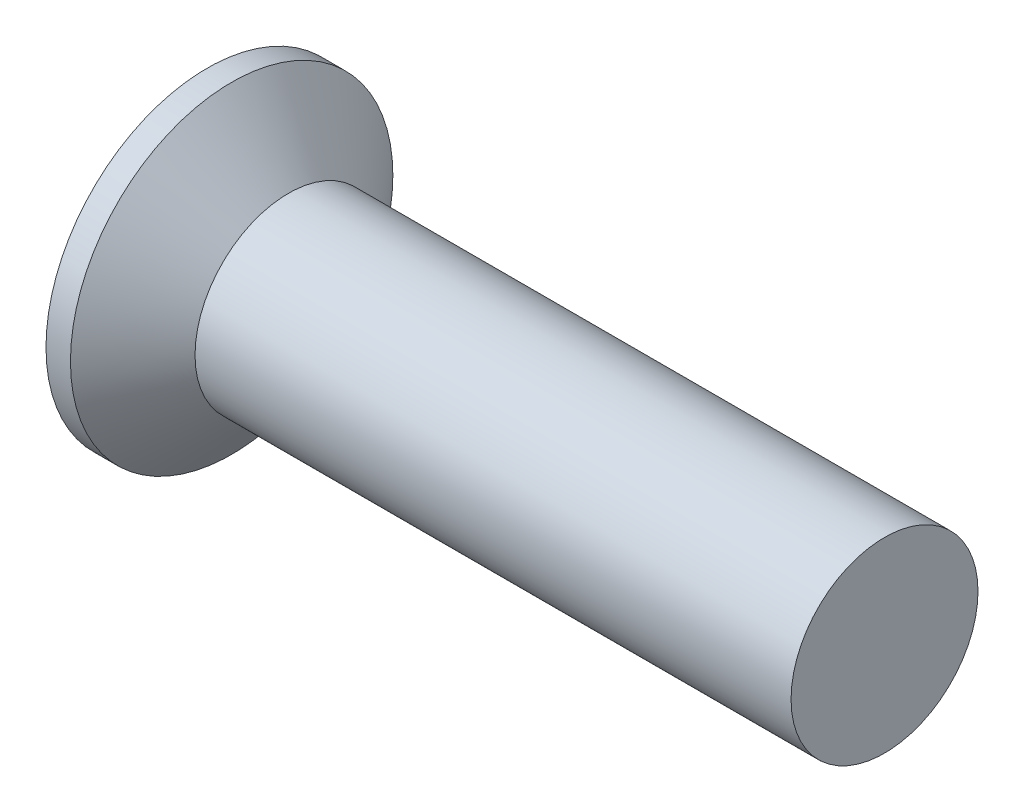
ISO-10303-21;
HEADER;
FILE_DESCRIPTION(('STEP AP214'),'2;1');
FILE_NAME('part.step','',(''),(''),'','','');
FILE_SCHEMA(('AUTOMOTIVE_DESIGN { 1 0 10303 214 1 1 1 1 }'));
ENDSEC;
DATA;
#1=APPLICATION_CONTEXT('core data for automotive mechanical design processes');
#2=APPLICATION_PROTOCOL_DEFINITION('international standard','automotive_design',2000,#1);
#3=PRODUCT_CONTEXT('',#1,'mechanical');
#4=PRODUCT('Part','Part','',(#3));
#5=PRODUCT_RELATED_PRODUCT_CATEGORY('part','',(#4));
#6=PRODUCT_DEFINITION_FORMATION('','',#4);
#7=PRODUCT_DEFINITION_CONTEXT('part definition',#1,'design');
#8=PRODUCT_DEFINITION('design','',#6,#7);
#9=PRODUCT_DEFINITION_SHAPE('','',#8);
#10=(LENGTH_UNIT() NAMED_UNIT(*) SI_UNIT(.MILLI.,.METRE.));
#11=(NAMED_UNIT(*) PLANE_ANGLE_UNIT() SI_UNIT($,.RADIAN.));
#12=(NAMED_UNIT(*) SI_UNIT($,.STERADIAN.) SOLID_ANGLE_UNIT());
#13=UNCERTAINTY_MEASURE_WITH_UNIT(LENGTH_MEASURE(1.E-05),#10,'distance_accuracy_value','');
#14=(GEOMETRIC_REPRESENTATION_CONTEXT(3) GLOBAL_UNCERTAINTY_ASSIGNED_CONTEXT((#13)) GLOBAL_UNIT_ASSIGNED_CONTEXT((#10,
#11,#12)) REPRESENTATION_CONTEXT('',''));
#15=CARTESIAN_POINT('',(0.,0.,0.));
#16=DIRECTION('',(0.,0.,1.));
#17=DIRECTION('',(1.,0.,0.));
#18=AXIS2_PLACEMENT_3D('',#15,#16,#17);
#19=CARTESIAN_POINT('',(0.,0.,0.));
#20=DIRECTION('',(-1.,0.,0.));
#21=DIRECTION('',(0.,0.,1.));
#22=AXIS2_PLACEMENT_3D('',#19,#20,#21);
#23=PLANE('',#22);
#24=CARTESIAN_POINT('',(0.,0.,0.));
#25=DIRECTION('',(-1.,0.,0.));
#26=DIRECTION('',(0.,0.,1.));
#27=AXIS2_PLACEMENT_3D('',#24,#25,#26);
#28=CIRCLE('',#27,3.0226);
#29=CARTESIAN_POINT('',(0.,0.,3.0226));
#30=VERTEX_POINT('',#29);
#31=EDGE_CURVE('E35',#30,#30,#28,.T.);
#32=ORIENTED_EDGE('',*,*,#31,.T.);
#33=EDGE_LOOP('',(#32));
#34=FACE_BOUND('',#33,.T.);
#35=DIRECTION('',(0.,1.,0.));
#36=VECTOR('',#35,1.);
#37=CARTESIAN_POINT('',(0.,-2.0574,-0.4191));
#38=LINE('',#37,#36);
#39=CARTESIAN_POINT('',(0.,-2.0574,-0.4191));
#40=VERTEX_POINT('',#39);
#41=CARTESIAN_POINT('',(0.,-0.419099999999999,-0.4191));
#42=VERTEX_POINT('',#41);
#43=EDGE_CURVE('E131',#40,#42,#38,.T.);
#44=ORIENTED_EDGE('',*,*,#43,.T.);
#45=DIRECTION('',(0.,0.,-1.));
#46=VECTOR('',#45,1.);
#47=CARTESIAN_POINT('',(0.,-0.419100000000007,2.0574));
#48=LINE('',#47,#46);
#49=CARTESIAN_POINT('',(0.,-0.419099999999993,-2.0574));
#50=VERTEX_POINT('',#49);
#51=EDGE_CURVE('E99',#42,#50,#48,.T.);
#52=ORIENTED_EDGE('',*,*,#51,.T.);
#53=DIRECTION('',(0.,1.,0.));
#54=VECTOR('',#53,1.);
#55=CARTESIAN_POINT('',(0.,-0.419099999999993,-2.0574));
#56=LINE('',#55,#54);
#57=CARTESIAN_POINT('',(0.,0.419100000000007,-2.0574));
#58=VERTEX_POINT('',#57);
#59=EDGE_CURVE('E109',#50,#58,#56,.T.);
#60=ORIENTED_EDGE('',*,*,#59,.T.);
#61=DIRECTION('',(0.,0.,1.));
#62=VECTOR('',#61,1.);
#63=CARTESIAN_POINT('',(0.,0.419100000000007,-2.0574));
#64=LINE('',#63,#62);
#65=CARTESIAN_POINT('',(0.,0.419100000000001,-0.419099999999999));
#66=VERTEX_POINT('',#65);
#67=EDGE_CURVE('E300',#58,#66,#64,.T.);
#68=ORIENTED_EDGE('',*,*,#67,.T.);
#69=CARTESIAN_POINT('',(0.,2.0574,-0.4191));
#70=VERTEX_POINT('',#69);
#71=EDGE_CURVE('E134',#66,#70,#38,.T.);
#72=ORIENTED_EDGE('',*,*,#71,.T.);
#73=DIRECTION('',(0.,0.,1.));
#74=VECTOR('',#73,1.);
#75=CARTESIAN_POINT('',(0.,2.0574,-0.4191));
#76=LINE('',#75,#74);
#77=CARTESIAN_POINT('',(0.,2.0574,0.4191));
#78=VERTEX_POINT('',#77);
#79=EDGE_CURVE('E138',#70,#78,#76,.T.);
#80=ORIENTED_EDGE('',*,*,#79,.T.);
#81=DIRECTION('',(0.,-1.,0.));
#82=VECTOR('',#81,1.);
#83=CARTESIAN_POINT('',(0.,2.0574,0.4191));
#84=LINE('',#83,#82);
#85=CARTESIAN_POINT('',(0.,0.419099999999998,0.4191));
#86=VERTEX_POINT('',#85);
#87=EDGE_CURVE('E142',#78,#86,#84,.T.);
#88=ORIENTED_EDGE('',*,*,#87,.T.);
#89=CARTESIAN_POINT('',(0.,0.419099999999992,2.0574));
#90=VERTEX_POINT('',#89);
#91=EDGE_CURVE('E110',#86,#90,#64,.T.);
#92=ORIENTED_EDGE('',*,*,#91,.T.);
#93=DIRECTION('',(0.,-1.,0.));
#94=VECTOR('',#93,1.);
#95=CARTESIAN_POINT('',(0.,0.419099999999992,2.0574));
#96=LINE('',#95,#94);
#97=CARTESIAN_POINT('',(0.,-0.419100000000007,2.0574));
#98=VERTEX_POINT('',#97);
#99=EDGE_CURVE('E292',#90,#98,#96,.T.);
#100=ORIENTED_EDGE('',*,*,#99,.T.);
#101=CARTESIAN_POINT('',(0.,-0.419100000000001,0.4191));
#102=VERTEX_POINT('',#101);
#103=EDGE_CURVE('E299',#98,#102,#48,.T.);
#104=ORIENTED_EDGE('',*,*,#103,.T.);
#105=CARTESIAN_POINT('',(0.,-2.0574,0.4191));
#106=VERTEX_POINT('',#105);
#107=EDGE_CURVE('E141',#102,#106,#84,.T.);
#108=ORIENTED_EDGE('',*,*,#107,.T.);
#109=DIRECTION('',(0.,0.,-1.));
#110=VECTOR('',#109,1.);
#111=CARTESIAN_POINT('',(0.,-2.0574,0.4191));
#112=LINE('',#111,#110);
#113=EDGE_CURVE('E145',#106,#40,#112,.T.);
#114=ORIENTED_EDGE('',*,*,#113,.T.);
#115=EDGE_LOOP('',(#44,#52,#60,#68,#72,#80,#88,#92,#100,#104,#108,#114));
#116=FACE_BOUND('',#115,.T.);
#117=ADVANCED_FACE('F28',(#34,#116),#23,.T.);
#118=CARTESIAN_POINT('',(2.99772371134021,0.,0.185786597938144));
#119=DIRECTION('',(-0.0775955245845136,0.,-0.996984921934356));
#120=DIRECTION('',(-0.996984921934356,0.,0.0775955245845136));
#121=AXIS2_PLACEMENT_3D('',#118,#119,#120);
#122=PLANE('',#121);
#123=ORIENTED_EDGE('',*,*,#107,.F.);
#124=DIRECTION('',(0.99399695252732,0.0773629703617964,-0.0773629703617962));
#125=VECTOR('',#124,1.);
#126=CARTESIAN_POINT('',(3.01201043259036,-0.184674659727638,0.184674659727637));
#127=LINE('',#126,#125);
#128=CARTESIAN_POINT('',(2.6924,-0.209550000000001,0.209549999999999));
#129=VERTEX_POINT('',#128);
#130=EDGE_CURVE('E128',#102,#129,#127,.T.);
#131=ORIENTED_EDGE('',*,*,#130,.T.);
#132=DIRECTION('',(0.822803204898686,0.564706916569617,-0.0640389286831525));
#133=VECTOR('',#132,1.);
#134=CARTESIAN_POINT('',(0.,-2.0574,0.4191));
#135=LINE('',#134,#133);
#136=EDGE_CURVE('E118',#106,#129,#135,.T.);
#137=ORIENTED_EDGE('',*,*,#136,.F.);
#138=EDGE_LOOP('',(#123,#131,#137));
#139=FACE_BOUND('',#138,.T.);
#140=ADVANCED_FACE('F176',(#139),#122,.T.);
#141=DIRECTION('',(0.822803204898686,-0.564706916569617,-0.0640389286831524));
#142=VECTOR('',#141,1.);
#143=CARTESIAN_POINT('',(0.,2.0574,0.4191));
#144=LINE('',#143,#142);
#145=CARTESIAN_POINT('',(2.6924,0.20955,0.20955));
#146=VERTEX_POINT('',#145);
#147=EDGE_CURVE('E42',#78,#146,#144,.T.);
#148=ORIENTED_EDGE('',*,*,#147,.T.);
#149=DIRECTION('',(-0.99399695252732,0.0773629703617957,0.0773629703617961));
#150=VECTOR('',#149,1.);
#151=CARTESIAN_POINT('',(3.01201043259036,0.184674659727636,0.184674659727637));
#152=LINE('',#151,#150);
#153=EDGE_CURVE('E310',#146,#86,#152,.T.);
#154=ORIENTED_EDGE('',*,*,#153,.T.);
#155=ORIENTED_EDGE('',*,*,#87,.F.);
#156=EDGE_LOOP('',(#148,#154,#155));
#157=FACE_BOUND('',#156,.T.);
#158=ADVANCED_FACE('F181',(#157),#122,.T.);
#159=CARTESIAN_POINT('',(2.99772371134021,0.,-0.185786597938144));
#160=DIRECTION('',(-0.0775955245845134,0.,0.996984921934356));
#161=DIRECTION('',(0.996984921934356,0.,0.0775955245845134));
#162=AXIS2_PLACEMENT_3D('',#159,#160,#161);
#163=PLANE('',#162);
#164=DIRECTION('',(0.822803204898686,0.564706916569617,0.0640389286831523));
#165=VECTOR('',#164,1.);
#166=CARTESIAN_POINT('',(0.,-2.0574,-0.4191));
#167=LINE('',#166,#165);
#168=CARTESIAN_POINT('',(2.6924,-0.209549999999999,-0.209550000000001));
#169=VERTEX_POINT('',#168);
#170=EDGE_CURVE('E50',#40,#169,#167,.T.);
#171=ORIENTED_EDGE('',*,*,#170,.T.);
#172=DIRECTION('',(-0.99399695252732,-0.0773629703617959,-0.077362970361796));
#173=VECTOR('',#172,1.);
#174=CARTESIAN_POINT('',(3.01201043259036,-0.184674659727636,-0.184674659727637));
#175=LINE('',#174,#173);
#176=EDGE_CURVE('E11',#169,#42,#175,.T.);
#177=ORIENTED_EDGE('',*,*,#176,.T.);
#178=ORIENTED_EDGE('',*,*,#43,.F.);
#179=EDGE_LOOP('',(#171,#177,#178));
#180=FACE_BOUND('',#179,.T.);
#181=ADVANCED_FACE('F130',(#180),#163,.T.);
#182=ORIENTED_EDGE('',*,*,#71,.F.);
#183=DIRECTION('',(0.99399695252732,-0.0773629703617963,0.077362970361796));
#184=VECTOR('',#183,1.);
#185=CARTESIAN_POINT('',(3.01201043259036,0.184674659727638,-0.184674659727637));
#186=LINE('',#185,#184);
#187=CARTESIAN_POINT('',(2.6924,0.20955,-0.20955));
#188=VERTEX_POINT('',#187);
#189=EDGE_CURVE('E307',#66,#188,#186,.T.);
#190=ORIENTED_EDGE('',*,*,#189,.T.);
#191=DIRECTION('',(0.822803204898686,-0.564706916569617,0.0640389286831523));
#192=VECTOR('',#191,1.);
#193=CARTESIAN_POINT('',(0.,2.0574,-0.4191));
#194=LINE('',#193,#192);
#195=EDGE_CURVE('E121',#70,#188,#194,.T.);
#196=ORIENTED_EDGE('',*,*,#195,.F.);
#197=EDGE_LOOP('',(#182,#190,#196));
#198=FACE_BOUND('',#197,.T.);
#199=ADVANCED_FACE('F164',(#198),#163,.T.);
#200=CARTESIAN_POINT('',(-6.34999999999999,0.,0.));
#201=DIRECTION('',(-1.,0.,0.));
#202=DIRECTION('',(0.,0.,1.));
#203=AXIS2_PLACEMENT_3D('',#200,#201,#202);
#204=CYLINDRICAL_SURFACE('',#203,3.0226);
#205=CARTESIAN_POINT('',(0.458343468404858,0.,0.));
#206=DIRECTION('',(-1.,0.,0.));
#207=DIRECTION('',(0.,0.,1.));
#208=AXIS2_PLACEMENT_3D('',#205,#206,#207);
#209=CIRCLE('',#208,3.0226);
#210=CARTESIAN_POINT('',(0.458343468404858,0.,3.0226));
#211=VERTEX_POINT('',#210);
#212=EDGE_CURVE('E154',#211,#211,#209,.T.);
#213=ORIENTED_EDGE('',*,*,#212,.T.);
#214=EDGE_LOOP('',(#213));
#215=FACE_BOUND('',#214,.T.);
#216=ORIENTED_EDGE('',*,*,#31,.F.);
#217=EDGE_LOOP('',(#216));
#218=FACE_BOUND('',#217,.T.);
#219=ADVANCED_FACE('F161',(#215,#218),#204,.T.);
#220=CARTESIAN_POINT('',(0.458343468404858,0.,0.));
#221=DIRECTION('',(-1.,0.,0.));
#222=DIRECTION('',(0.,0.,1.));
#223=AXIS2_PLACEMENT_3D('',#220,#221,#222);
#224=CONICAL_SURFACE('',#223,3.0226,0.872664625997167);
#225=CARTESIAN_POINT('',(1.524,0.,0.));
#226=DIRECTION('',(-1.,0.,0.));
#227=DIRECTION('',(0.,0.,1.));
#228=AXIS2_PLACEMENT_3D('',#225,#226,#227);
#229=CIRCLE('',#228,1.7526);
#230=CARTESIAN_POINT('',(1.524,0.,1.7526));
#231=VERTEX_POINT('',#230);
#232=EDGE_CURVE('E151',#231,#231,#229,.T.);
#233=ORIENTED_EDGE('',*,*,#232,.T.);
#234=EDGE_LOOP('',(#233));
#235=FACE_BOUND('',#234,.T.);
#236=ORIENTED_EDGE('',*,*,#212,.F.);
#237=EDGE_LOOP('',(#236));
#238=FACE_BOUND('',#237,.T.);
#239=ADVANCED_FACE('F163',(#235,#238),#224,.T.);
#240=CARTESIAN_POINT('',(-6.34999999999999,0.,0.));
#241=DIRECTION('',(-1.,0.,0.));
#242=DIRECTION('',(0.,0.,1.));
#243=AXIS2_PLACEMENT_3D('',#240,#241,#242);
#244=CYLINDRICAL_SURFACE('',#243,1.7526);
#245=CARTESIAN_POINT('',(12.7,0.,0.));
#246=DIRECTION('',(-1.,0.,0.));
#247=DIRECTION('',(0.,0.,1.));
#248=AXIS2_PLACEMENT_3D('',#245,#246,#247);
#249=CIRCLE('',#248,1.7526);
#250=CARTESIAN_POINT('',(12.7,0.,1.7526));
#251=VERTEX_POINT('',#250);
#252=EDGE_CURVE('E147',#251,#251,#249,.T.);
#253=ORIENTED_EDGE('',*,*,#252,.T.);
#254=EDGE_LOOP('',(#253));
#255=FACE_BOUND('',#254,.T.);
#256=ORIENTED_EDGE('',*,*,#232,.F.);
#257=EDGE_LOOP('',(#256));
#258=FACE_BOUND('',#257,.T.);
#259=ADVANCED_FACE('F169',(#255,#258),#244,.T.);
#260=CARTESIAN_POINT('',(12.7,1.7526,0.));
#261=DIRECTION('',(1.,0.,0.));
#262=DIRECTION('',(0.,0.,-1.));
#263=AXIS2_PLACEMENT_3D('',#260,#261,#262);
#264=PLANE('',#263);
#265=ORIENTED_EDGE('',*,*,#252,.F.);
#266=EDGE_LOOP('',(#265));
#267=FACE_BOUND('',#266,.T.);
#268=ADVANCED_FACE('F194',(#267),#264,.T.);
#269=CARTESIAN_POINT('',(2.6924,-0.20955,-0.20955));
#270=DIRECTION('',(-1.,0.,0.));
#271=DIRECTION('',(0.,0.,1.));
#272=AXIS2_PLACEMENT_3D('',#269,#270,#271);
#273=PLANE('',#272);
#274=DIRECTION('',(0.,1.,0.));
#275=VECTOR('',#274,1.);
#276=CARTESIAN_POINT('',(2.6924,-0.20955,-0.20955));
#277=LINE('',#276,#275);
#278=EDGE_CURVE('E106',#169,#188,#277,.T.);
#279=ORIENTED_EDGE('',*,*,#278,.F.);
#280=DIRECTION('',(0.,0.,-1.));
#281=VECTOR('',#280,1.);
#282=CARTESIAN_POINT('',(2.6924,-0.20955,0.20955));
#283=LINE('',#282,#281);
#284=EDGE_CURVE('E115',#129,#169,#283,.T.);
#285=ORIENTED_EDGE('',*,*,#284,.F.);
#286=DIRECTION('',(0.,-1.,0.));
#287=VECTOR('',#286,1.);
#288=CARTESIAN_POINT('',(2.6924,0.20955,0.20955));
#289=LINE('',#288,#287);
#290=EDGE_CURVE('E122',#146,#129,#289,.T.);
#291=ORIENTED_EDGE('',*,*,#290,.F.);
#292=DIRECTION('',(0.,0.,1.));
#293=VECTOR('',#292,1.);
#294=CARTESIAN_POINT('',(2.6924,0.20955,-0.20955));
#295=LINE('',#294,#293);
#296=EDGE_CURVE('E126',#188,#146,#295,.T.);
#297=ORIENTED_EDGE('',*,*,#296,.F.);
#298=EDGE_LOOP('',(#279,#285,#291,#297));
#299=FACE_BOUND('',#298,.T.);
#300=ADVANCED_FACE('F125',(#299),#273,.T.);
#301=CARTESIAN_POINT('',(0.,-2.0574,-0.4191));
#302=DIRECTION('',(-0.56586841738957,0.82449556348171,0.));
#303=DIRECTION('',(-0.82449556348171,-0.56586841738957,0.));
#304=AXIS2_PLACEMENT_3D('',#301,#302,#303);
#305=PLANE('',#304);
#306=ORIENTED_EDGE('',*,*,#170,.F.);
#307=ORIENTED_EDGE('',*,*,#113,.F.);
#308=ORIENTED_EDGE('',*,*,#136,.T.);
#309=ORIENTED_EDGE('',*,*,#284,.T.);
#310=EDGE_LOOP('',(#306,#307,#308,#309));
#311=FACE_BOUND('',#310,.T.);
#312=ADVANCED_FACE('F116',(#311),#305,.T.);
#313=CARTESIAN_POINT('',(2.6924,0.20955,0.20955));
#314=DIRECTION('',(-0.56586841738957,-0.82449556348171,0.));
#315=DIRECTION('',(0.82449556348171,-0.56586841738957,0.));
#316=AXIS2_PLACEMENT_3D('',#313,#314,#315);
#317=PLANE('',#316);
#318=ORIENTED_EDGE('',*,*,#147,.F.);
#319=ORIENTED_EDGE('',*,*,#79,.F.);
#320=ORIENTED_EDGE('',*,*,#195,.T.);
#321=ORIENTED_EDGE('',*,*,#296,.T.);
#322=EDGE_LOOP('',(#318,#319,#320,#321));
#323=FACE_BOUND('',#322,.T.);
#324=ADVANCED_FACE('F193',(#323),#317,.T.);
#325=CARTESIAN_POINT('',(2.99772371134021,-0.185786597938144,0.));
#326=DIRECTION('',(-0.0775955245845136,0.996984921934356,0.));
#327=DIRECTION('',(-0.996984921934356,-0.0775955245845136,0.));
#328=AXIS2_PLACEMENT_3D('',#325,#326,#327);
#329=PLANE('',#328);
#330=DIRECTION('',(0.822803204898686,0.0640389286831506,0.564706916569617));
#331=VECTOR('',#330,1.);
#332=CARTESIAN_POINT('',(0.,-0.419099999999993,-2.0574));
#333=LINE('',#332,#331);
#334=EDGE_CURVE('E97',#50,#169,#333,.T.);
#335=ORIENTED_EDGE('',*,*,#334,.F.);
#336=ORIENTED_EDGE('',*,*,#51,.F.);
#337=ORIENTED_EDGE('',*,*,#176,.F.);
#338=EDGE_LOOP('',(#335,#336,#337));
#339=FACE_BOUND('',#338,.T.);
#340=ADVANCED_FACE('F96',(#339),#329,.T.);
#341=CARTESIAN_POINT('',(2.99772371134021,0.185786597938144,0.));
#342=DIRECTION('',(-0.0775955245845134,-0.996984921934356,0.));
#343=DIRECTION('',(0.996984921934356,-0.0775955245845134,0.));
#344=AXIS2_PLACEMENT_3D('',#341,#342,#343);
#345=PLANE('',#344);
#346=ORIENTED_EDGE('',*,*,#67,.F.);
#347=DIRECTION('',(0.822803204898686,-0.0640389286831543,0.564706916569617));
#348=VECTOR('',#347,1.);
#349=CARTESIAN_POINT('',(0.,0.419100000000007,-2.0574));
#350=LINE('',#349,#348);
#351=EDGE_CURVE('E111',#58,#188,#350,.T.);
#352=ORIENTED_EDGE('',*,*,#351,.T.);
#353=ORIENTED_EDGE('',*,*,#189,.F.);
#354=EDGE_LOOP('',(#346,#352,#353));
#355=FACE_BOUND('',#354,.T.);
#356=ADVANCED_FACE('F251',(#355),#345,.T.);
#357=CARTESIAN_POINT('',(0.,0.419100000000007,-2.0574));
#358=DIRECTION('',(-0.56586841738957,0.,0.82449556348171));
#359=DIRECTION('',(-0.82449556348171,0.,-0.56586841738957));
#360=AXIS2_PLACEMENT_3D('',#357,#358,#359);
#361=PLANE('',#360);
#362=ORIENTED_EDGE('',*,*,#351,.F.);
#363=ORIENTED_EDGE('',*,*,#59,.F.);
#364=ORIENTED_EDGE('',*,*,#334,.T.);
#365=ORIENTED_EDGE('',*,*,#278,.T.);
#366=EDGE_LOOP('',(#362,#363,#364,#365));
#367=FACE_BOUND('',#366,.T.);
#368=ADVANCED_FACE('F104',(#367),#361,.T.);
#369=ORIENTED_EDGE('',*,*,#103,.F.);
#370=DIRECTION('',(0.822803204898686,0.0640389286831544,-0.564706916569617));
#371=VECTOR('',#370,1.);
#372=CARTESIAN_POINT('',(0.,-0.419100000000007,2.0574));
#373=LINE('',#372,#371);
#374=EDGE_CURVE('E290',#98,#129,#373,.T.);
#375=ORIENTED_EDGE('',*,*,#374,.T.);
#376=ORIENTED_EDGE('',*,*,#130,.F.);
#377=EDGE_LOOP('',(#369,#375,#376));
#378=FACE_BOUND('',#377,.T.);
#379=ADVANCED_FACE('F253',(#378),#329,.T.);
#380=DIRECTION('',(0.822803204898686,-0.0640389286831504,-0.564706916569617));
#381=VECTOR('',#380,1.);
#382=CARTESIAN_POINT('',(0.,0.419099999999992,2.0574));
#383=LINE('',#382,#381);
#384=EDGE_CURVE('E295',#90,#146,#383,.T.);
#385=ORIENTED_EDGE('',*,*,#384,.F.);
#386=ORIENTED_EDGE('',*,*,#91,.F.);
#387=ORIENTED_EDGE('',*,*,#153,.F.);
#388=EDGE_LOOP('',(#385,#386,#387));
#389=FACE_BOUND('',#388,.T.);
#390=ADVANCED_FACE('F261',(#389),#345,.T.);
#391=CARTESIAN_POINT('',(2.6924,-0.209550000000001,0.209549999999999));
#392=DIRECTION('',(-0.56586841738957,0.,-0.82449556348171));
#393=DIRECTION('',(0.82449556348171,0.,-0.56586841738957));
#394=AXIS2_PLACEMENT_3D('',#391,#392,#393);
#395=PLANE('',#394);
#396=ORIENTED_EDGE('',*,*,#374,.F.);
#397=ORIENTED_EDGE('',*,*,#99,.F.);
#398=ORIENTED_EDGE('',*,*,#384,.T.);
#399=ORIENTED_EDGE('',*,*,#290,.T.);
#400=EDGE_LOOP('',(#396,#397,#398,#399));
#401=FACE_BOUND('',#400,.T.);
#402=ADVANCED_FACE('F279',(#401),#395,.T.);
#403=CLOSED_SHELL('',(#117,#140,#158,#181,#199,#219,#239,#259,#268,#300,#312,#324,#340,#356,
#368,#379,#390,#402));
#404=MANIFOLD_SOLID_BREP('B2',#403);
#405=ADVANCED_BREP_SHAPE_REPRESENTATION('',(#18,#404),#14);
#406=SHAPE_DEFINITION_REPRESENTATION(#9,#405);
ENDSEC;
END-ISO-10303-21;
